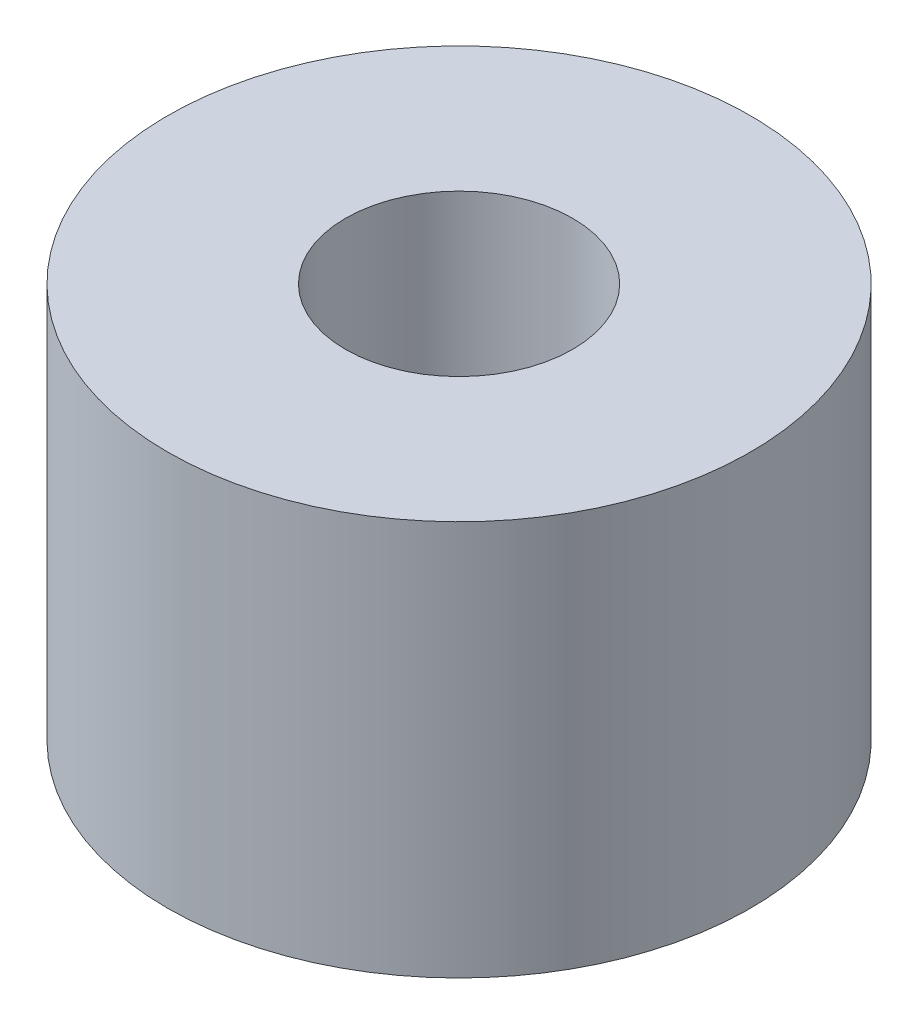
ISO-10303-21;
HEADER;
FILE_DESCRIPTION(('STEP AP214'),'2;1');
FILE_NAME('part.step','',(''),(''),'','','');
FILE_SCHEMA(('AUTOMOTIVE_DESIGN { 1 0 10303 214 1 1 1 1 }'));
ENDSEC;
DATA;
#1=APPLICATION_CONTEXT('core data for automotive mechanical design processes');
#2=APPLICATION_PROTOCOL_DEFINITION('international standard','automotive_design',2000,#1);
#3=PRODUCT_CONTEXT('',#1,'mechanical');
#4=PRODUCT('Part','Part','',(#3));
#5=PRODUCT_RELATED_PRODUCT_CATEGORY('part','',(#4));
#6=PRODUCT_DEFINITION_FORMATION('','',#4);
#7=PRODUCT_DEFINITION_CONTEXT('part definition',#1,'design');
#8=PRODUCT_DEFINITION('design','',#6,#7);
#9=PRODUCT_DEFINITION_SHAPE('','',#8);
#10=(LENGTH_UNIT() NAMED_UNIT(*) SI_UNIT(.MILLI.,.METRE.));
#11=(NAMED_UNIT(*) PLANE_ANGLE_UNIT() SI_UNIT($,.RADIAN.));
#12=(NAMED_UNIT(*) SI_UNIT($,.STERADIAN.) SOLID_ANGLE_UNIT());
#13=UNCERTAINTY_MEASURE_WITH_UNIT(LENGTH_MEASURE(1.E-05),#10,'distance_accuracy_value','');
#14=(GEOMETRIC_REPRESENTATION_CONTEXT(3) GLOBAL_UNCERTAINTY_ASSIGNED_CONTEXT((#13)) GLOBAL_UNIT_ASSIGNED_CONTEXT((#10,
#11,#12)) REPRESENTATION_CONTEXT('',''));
#15=CARTESIAN_POINT('',(0.,0.,0.));
#16=DIRECTION('',(0.,0.,1.));
#17=DIRECTION('',(1.,0.,0.));
#18=AXIS2_PLACEMENT_3D('',#15,#16,#17);
#19=CARTESIAN_POINT('',(0.,4.,0.));
#20=DIRECTION('',(0.,1.,0.));
#21=DIRECTION('',(0.,0.,1.));
#22=AXIS2_PLACEMENT_3D('',#19,#20,#21);
#23=PLANE('',#22);
#24=CARTESIAN_POINT('',(0.,4.,0.));
#25=DIRECTION('',(0.,1.,0.));
#26=DIRECTION('',(0.,0.,1.));
#27=AXIS2_PLACEMENT_3D('',#24,#25,#26);
#28=CIRCLE('',#27,2.95);
#29=CARTESIAN_POINT('',(0.,4.,2.95));
#30=VERTEX_POINT('',#29);
#31=EDGE_CURVE('E10',#30,#30,#28,.T.);
#32=ORIENTED_EDGE('',*,*,#31,.T.);
#33=EDGE_LOOP('',(#32));
#34=FACE_BOUND('',#33,.T.);
#35=CARTESIAN_POINT('',(0.,4.,0.));
#36=DIRECTION('',(0.,1.,0.));
#37=DIRECTION('',(0.,0.,1.));
#38=AXIS2_PLACEMENT_3D('',#35,#36,#37);
#39=CIRCLE('',#38,1.15);
#40=CARTESIAN_POINT('',(0.,4.,1.15));
#41=VERTEX_POINT('',#40);
#42=EDGE_CURVE('E43',#41,#41,#39,.T.);
#43=ORIENTED_EDGE('',*,*,#42,.F.);
#44=EDGE_LOOP('',(#43));
#45=FACE_BOUND('',#44,.T.);
#46=ADVANCED_FACE('F32',(#34,#45),#23,.T.);
#47=CARTESIAN_POINT('',(0.,0.,0.));
#48=DIRECTION('',(0.,1.,0.));
#49=DIRECTION('',(0.,0.,1.));
#50=AXIS2_PLACEMENT_3D('',#47,#48,#49);
#51=PLANE('',#50);
#52=CARTESIAN_POINT('',(0.,0.,0.));
#53=DIRECTION('',(0.,1.,0.));
#54=DIRECTION('',(0.,0.,1.));
#55=AXIS2_PLACEMENT_3D('',#52,#53,#54);
#56=CIRCLE('',#55,2.95);
#57=CARTESIAN_POINT('',(0.,0.,2.95));
#58=VERTEX_POINT('',#57);
#59=EDGE_CURVE('E36',#58,#58,#56,.T.);
#60=ORIENTED_EDGE('',*,*,#59,.F.);
#61=EDGE_LOOP('',(#60));
#62=FACE_BOUND('',#61,.T.);
#63=CARTESIAN_POINT('',(0.,0.,0.));
#64=DIRECTION('',(0.,1.,0.));
#65=DIRECTION('',(0.,0.,1.));
#66=AXIS2_PLACEMENT_3D('',#63,#64,#65);
#67=CIRCLE('',#66,1.15);
#68=CARTESIAN_POINT('',(0.,0.,1.15));
#69=VERTEX_POINT('',#68);
#70=EDGE_CURVE('E45',#69,#69,#67,.T.);
#71=ORIENTED_EDGE('',*,*,#70,.T.);
#72=EDGE_LOOP('',(#71));
#73=FACE_BOUND('',#72,.T.);
#74=ADVANCED_FACE('F55',(#62,#73),#51,.F.);
#75=CARTESIAN_POINT('',(0.,4.,0.));
#76=DIRECTION('',(0.,-1.,0.));
#77=DIRECTION('',(0.,0.,-1.));
#78=AXIS2_PLACEMENT_3D('',#75,#76,#77);
#79=CYLINDRICAL_SURFACE('',#78,2.95);
#80=ORIENTED_EDGE('',*,*,#31,.F.);
#81=EDGE_LOOP('',(#80));
#82=FACE_BOUND('',#81,.T.);
#83=ORIENTED_EDGE('',*,*,#59,.T.);
#84=EDGE_LOOP('',(#83));
#85=FACE_BOUND('',#84,.T.);
#86=ADVANCED_FACE('F34',(#82,#85),#79,.T.);
#87=CARTESIAN_POINT('',(0.,4.,0.));
#88=DIRECTION('',(0.,-1.,0.));
#89=DIRECTION('',(0.,0.,-1.));
#90=AXIS2_PLACEMENT_3D('',#87,#88,#89);
#91=CYLINDRICAL_SURFACE('',#90,1.15);
#92=ORIENTED_EDGE('',*,*,#42,.T.);
#93=EDGE_LOOP('',(#92));
#94=FACE_BOUND('',#93,.T.);
#95=ORIENTED_EDGE('',*,*,#70,.F.);
#96=EDGE_LOOP('',(#95));
#97=FACE_BOUND('',#96,.T.);
#98=ADVANCED_FACE('F51',(#94,#97),#91,.F.);
#99=CLOSED_SHELL('',(#46,#74,#86,#98));
#100=MANIFOLD_SOLID_BREP('B2',#99);
#101=ADVANCED_BREP_SHAPE_REPRESENTATION('',(#18,#100),#14);
#102=SHAPE_DEFINITION_REPRESENTATION(#9,#101);
ENDSEC;
END-ISO-10303-21;
